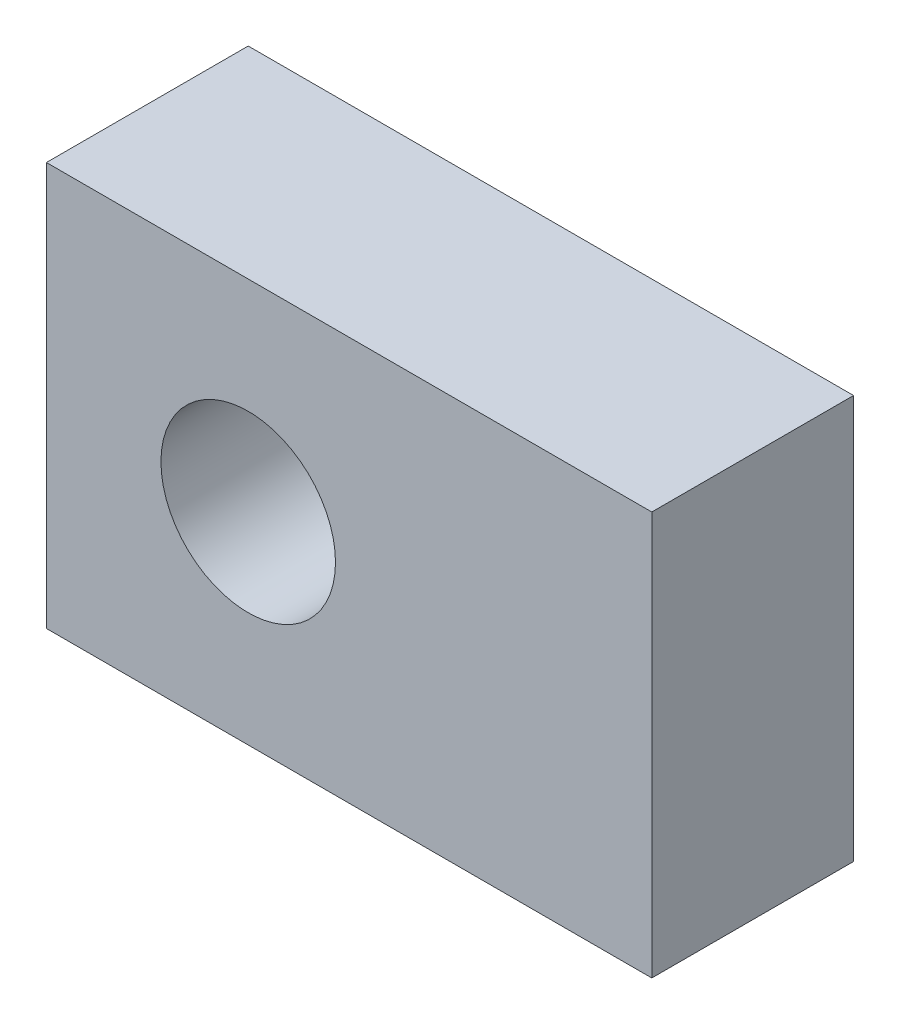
from build123d import *

# Parameters (mm, degrees)
SZKIC1_W                    = 60
SZKIC1_H                    = 40
SZKIC1_R                    = 8.65
DODANIE_WYCI_GNI_CIE1_DEPTH = 20


with BuildPart() as part:
    # Szkic1 → Dodanie-wyci_gni_cie1 (new body)
    with BuildSketch(Plane.XY):
        with Locations((30, 0)):
            Rectangle(SZKIC1_W, SZKIC1_H)
        with Locations((20, 0)):
            Circle(SZKIC1_R, mode=Mode.SUBTRACT)
    extrude(amount=DODANIE_WYCI_GNI_CIE1_DEPTH)


solid = part.part
